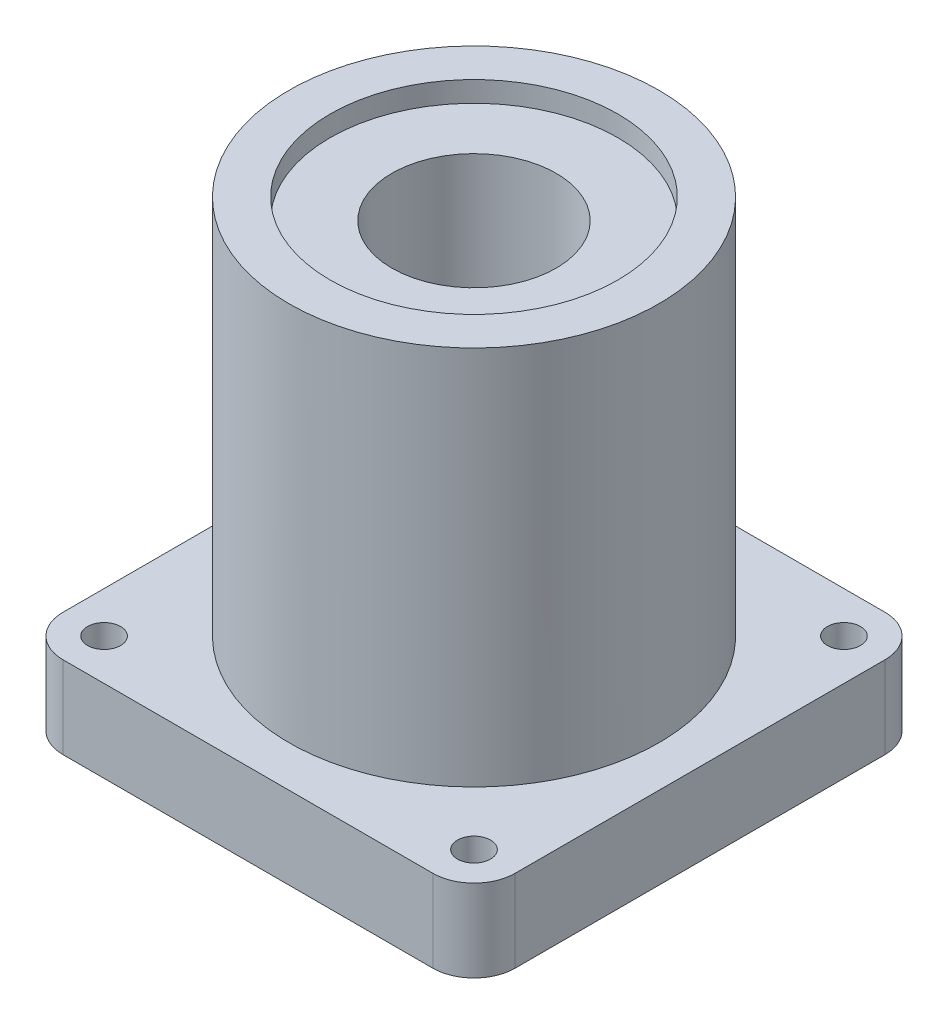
ISO-10303-21;
HEADER;
FILE_DESCRIPTION(('STEP AP214'),'2;1');
FILE_NAME('part.step','',(''),(''),'','','');
FILE_SCHEMA(('AUTOMOTIVE_DESIGN { 1 0 10303 214 1 1 1 1 }'));
ENDSEC;
DATA;
#1=APPLICATION_CONTEXT('core data for automotive mechanical design processes');
#2=APPLICATION_PROTOCOL_DEFINITION('international standard','automotive_design',2000,#1);
#3=PRODUCT_CONTEXT('',#1,'mechanical');
#4=PRODUCT('Part','Part','',(#3));
#5=PRODUCT_RELATED_PRODUCT_CATEGORY('part','',(#4));
#6=PRODUCT_DEFINITION_FORMATION('','',#4);
#7=PRODUCT_DEFINITION_CONTEXT('part definition',#1,'design');
#8=PRODUCT_DEFINITION('design','',#6,#7);
#9=PRODUCT_DEFINITION_SHAPE('','',#8);
#10=(LENGTH_UNIT() NAMED_UNIT(*) SI_UNIT(.MILLI.,.METRE.));
#11=(NAMED_UNIT(*) PLANE_ANGLE_UNIT() SI_UNIT($,.RADIAN.));
#12=(NAMED_UNIT(*) SI_UNIT($,.STERADIAN.) SOLID_ANGLE_UNIT());
#13=UNCERTAINTY_MEASURE_WITH_UNIT(LENGTH_MEASURE(1.E-05),#10,'distance_accuracy_value','');
#14=(GEOMETRIC_REPRESENTATION_CONTEXT(3) GLOBAL_UNCERTAINTY_ASSIGNED_CONTEXT((#13)) GLOBAL_UNIT_ASSIGNED_CONTEXT((#10,
#11,#12)) REPRESENTATION_CONTEXT('',''));
#15=CARTESIAN_POINT('',(0.,0.,0.));
#16=DIRECTION('',(0.,0.,1.));
#17=DIRECTION('',(1.,0.,0.));
#18=AXIS2_PLACEMENT_3D('',#15,#16,#17);
#19=CARTESIAN_POINT('',(0.,0.,0.));
#20=DIRECTION('',(0.,1.,0.));
#21=DIRECTION('',(0.,0.,1.));
#22=AXIS2_PLACEMENT_3D('',#19,#20,#21);
#23=CYLINDRICAL_SURFACE('',#22,12.7);
#24=CARTESIAN_POINT('',(0.,0.,0.));
#25=DIRECTION('',(0.,1.,0.));
#26=DIRECTION('',(0.,0.,1.));
#27=AXIS2_PLACEMENT_3D('',#24,#25,#26);
#28=CIRCLE('',#27,12.7);
#29=CARTESIAN_POINT('',(0.,0.,12.7));
#30=VERTEX_POINT('',#29);
#31=EDGE_CURVE('E181',#30,#30,#28,.T.);
#32=ORIENTED_EDGE('',*,*,#31,.F.);
#33=EDGE_LOOP('',(#32));
#34=FACE_BOUND('',#33,.T.);
#35=CARTESIAN_POINT('',(0.,68.2625,0.));
#36=DIRECTION('',(0.,1.,0.));
#37=DIRECTION('',(0.,0.,1.));
#38=AXIS2_PLACEMENT_3D('',#35,#36,#37);
#39=CIRCLE('',#38,12.7);
#40=CARTESIAN_POINT('',(0.,68.2625,12.7));
#41=VERTEX_POINT('',#40);
#42=EDGE_CURVE('E128',#41,#41,#39,.F.);
#43=ORIENTED_EDGE('',*,*,#42,.F.);
#44=EDGE_LOOP('',(#43));
#45=FACE_BOUND('',#44,.T.);
#46=ADVANCED_FACE('F30',(#34,#45),#23,.F.);
#47=CARTESIAN_POINT('',(-34.925,12.7,34.925));
#48=DIRECTION('',(0.,-1.,0.));
#49=DIRECTION('',(0.,0.,-1.));
#50=AXIS2_PLACEMENT_3D('',#47,#48,#49);
#51=PLANE('',#50);
#52=CARTESIAN_POINT('',(28.5749999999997,12.7,-28.5750000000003));
#53=DIRECTION('',(0.,1.,0.));
#54=DIRECTION('',(0.,0.,1.));
#55=AXIS2_PLACEMENT_3D('',#52,#53,#54);
#56=CIRCLE('',#55,2.55269999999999);
#57=CARTESIAN_POINT('',(28.5749999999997,12.7,-26.0223000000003));
#58=VERTEX_POINT('',#57);
#59=EDGE_CURVE('E171',#58,#58,#56,.T.);
#60=ORIENTED_EDGE('',*,*,#59,.F.);
#61=EDGE_LOOP('',(#60));
#62=FACE_BOUND('',#61,.T.);
#63=CARTESIAN_POINT('',(28.5750000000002,12.7,28.5749999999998));
#64=DIRECTION('',(0.,1.,0.));
#65=DIRECTION('',(0.,0.,1.));
#66=AXIS2_PLACEMENT_3D('',#63,#64,#65);
#67=CIRCLE('',#66,2.55269999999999);
#68=CARTESIAN_POINT('',(28.5750000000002,12.7,31.1276999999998));
#69=VERTEX_POINT('',#68);
#70=EDGE_CURVE('E161',#69,#69,#67,.T.);
#71=ORIENTED_EDGE('',*,*,#70,.F.);
#72=EDGE_LOOP('',(#71));
#73=FACE_BOUND('',#72,.T.);
#74=CARTESIAN_POINT('',(-28.5749999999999,12.7,28.5750000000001));
#75=DIRECTION('',(0.,1.,0.));
#76=DIRECTION('',(0.,0.,1.));
#77=AXIS2_PLACEMENT_3D('',#74,#75,#76);
#78=CIRCLE('',#77,2.55269999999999);
#79=CARTESIAN_POINT('',(-28.5749999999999,12.7,31.1277000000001));
#80=VERTEX_POINT('',#79);
#81=EDGE_CURVE('E158',#80,#80,#78,.T.);
#82=ORIENTED_EDGE('',*,*,#81,.F.);
#83=EDGE_LOOP('',(#82));
#84=FACE_BOUND('',#83,.T.);
#85=CARTESIAN_POINT('',(-28.575,12.7,-28.575));
#86=DIRECTION('',(0.,1.,0.));
#87=DIRECTION('',(0.,0.,1.));
#88=AXIS2_PLACEMENT_3D('',#85,#86,#87);
#89=CIRCLE('',#88,2.55269999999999);
#90=CARTESIAN_POINT('',(-28.575,12.7,-26.0223));
#91=VERTEX_POINT('',#90);
#92=EDGE_CURVE('E155',#91,#91,#89,.T.);
#93=ORIENTED_EDGE('',*,*,#92,.F.);
#94=EDGE_LOOP('',(#93));
#95=FACE_BOUND('',#94,.T.);
#96=DIRECTION('',(1.,0.,0.));
#97=VECTOR('',#96,1.);
#98=CARTESIAN_POINT('',(-34.925,12.7,34.925));
#99=LINE('',#98,#97);
#100=CARTESIAN_POINT('',(-28.575,12.7,34.925));
#101=VERTEX_POINT('',#100);
#102=CARTESIAN_POINT('',(28.575,12.7,34.925));
#103=VERTEX_POINT('',#102);
#104=EDGE_CURVE('E125',#101,#103,#99,.T.);
#105=ORIENTED_EDGE('',*,*,#104,.T.);
#106=CARTESIAN_POINT('',(28.575,12.7,28.575));
#107=DIRECTION('',(0.,-1.,0.));
#108=DIRECTION('',(0.,0.,-1.));
#109=AXIS2_PLACEMENT_3D('',#106,#107,#108);
#110=CIRCLE('',#109,6.35);
#111=CARTESIAN_POINT('',(34.925,12.7,28.575));
#112=VERTEX_POINT('',#111);
#113=EDGE_CURVE('E144',#103,#112,#110,.F.);
#114=ORIENTED_EDGE('',*,*,#113,.T.);
#115=DIRECTION('',(0.,0.,1.));
#116=VECTOR('',#115,1.);
#117=CARTESIAN_POINT('',(34.925,12.7,-34.925));
#118=LINE('',#117,#116);
#119=CARTESIAN_POINT('',(34.925,12.7,-28.575));
#120=VERTEX_POINT('',#119);
#121=EDGE_CURVE('E198',#120,#112,#118,.T.);
#122=ORIENTED_EDGE('',*,*,#121,.F.);
#123=CARTESIAN_POINT('',(28.575,12.7,-28.575));
#124=DIRECTION('',(0.,-1.,0.));
#125=DIRECTION('',(0.,0.,-1.));
#126=AXIS2_PLACEMENT_3D('',#123,#124,#125);
#127=CIRCLE('',#126,6.35);
#128=CARTESIAN_POINT('',(28.575,12.7,-34.925));
#129=VERTEX_POINT('',#128);
#130=EDGE_CURVE('E54',#120,#129,#127,.F.);
#131=ORIENTED_EDGE('',*,*,#130,.T.);
#132=DIRECTION('',(-1.,0.,0.));
#133=VECTOR('',#132,1.);
#134=CARTESIAN_POINT('',(34.925,12.7,-34.925));
#135=LINE('',#134,#133);
#136=CARTESIAN_POINT('',(-28.575,12.7,-34.925));
#137=VERTEX_POINT('',#136);
#138=EDGE_CURVE('E196',#129,#137,#135,.T.);
#139=ORIENTED_EDGE('',*,*,#138,.T.);
#140=CARTESIAN_POINT('',(-28.575,12.7,-28.575));
#141=DIRECTION('',(0.,-1.,0.));
#142=DIRECTION('',(0.,0.,-1.));
#143=AXIS2_PLACEMENT_3D('',#140,#141,#142);
#144=CIRCLE('',#143,6.35);
#145=CARTESIAN_POINT('',(-34.925,12.7,-28.575));
#146=VERTEX_POINT('',#145);
#147=EDGE_CURVE('E139',#137,#146,#144,.F.);
#148=ORIENTED_EDGE('',*,*,#147,.T.);
#149=DIRECTION('',(0.,0.,-1.));
#150=VECTOR('',#149,1.);
#151=CARTESIAN_POINT('',(-34.925,12.7,34.925));
#152=LINE('',#151,#150);
#153=CARTESIAN_POINT('',(-34.925,12.7,28.575));
#154=VERTEX_POINT('',#153);
#155=EDGE_CURVE('E193',#154,#146,#152,.T.);
#156=ORIENTED_EDGE('',*,*,#155,.F.);
#157=CARTESIAN_POINT('',(-28.575,12.7,28.575));
#158=DIRECTION('',(0.,-1.,0.));
#159=DIRECTION('',(0.,0.,-1.));
#160=AXIS2_PLACEMENT_3D('',#157,#158,#159);
#161=CIRCLE('',#160,6.35);
#162=EDGE_CURVE('E141',#154,#101,#161,.F.);
#163=ORIENTED_EDGE('',*,*,#162,.T.);
#164=EDGE_LOOP('',(#105,#114,#122,#131,#139,#148,#156,#163));
#165=FACE_BOUND('',#164,.T.);
#166=CARTESIAN_POINT('',(0.,12.7,0.));
#167=DIRECTION('',(0.,-1.,0.));
#168=DIRECTION('',(0.,0.,-1.));
#169=AXIS2_PLACEMENT_3D('',#166,#167,#168);
#170=CIRCLE('',#169,28.575);
#171=CARTESIAN_POINT('',(0.,12.7,-28.575));
#172=VERTEX_POINT('',#171);
#173=EDGE_CURVE('E120',#172,#172,#170,.F.);
#174=ORIENTED_EDGE('',*,*,#173,.F.);
#175=EDGE_LOOP('',(#174));
#176=FACE_BOUND('',#175,.T.);
#177=ADVANCED_FACE('F202',(#62,#73,#84,#95,#165,#176),#51,.F.);
#178=CARTESIAN_POINT('',(-34.925,12.7,34.925));
#179=DIRECTION('',(-1.,0.,0.));
#180=DIRECTION('',(0.,0.,1.));
#181=AXIS2_PLACEMENT_3D('',#178,#179,#180);
#182=PLANE('',#181);
#183=DIRECTION('',(0.,0.,-1.));
#184=VECTOR('',#183,1.);
#185=CARTESIAN_POINT('',(-34.925,0.,34.925));
#186=LINE('',#185,#184);
#187=CARTESIAN_POINT('',(-34.925,0.,28.575));
#188=VERTEX_POINT('',#187);
#189=CARTESIAN_POINT('',(-34.925,0.,-28.575));
#190=VERTEX_POINT('',#189);
#191=EDGE_CURVE('E186',#188,#190,#186,.T.);
#192=ORIENTED_EDGE('',*,*,#191,.F.);
#193=DIRECTION('',(0.,-1.,0.));
#194=VECTOR('',#193,1.);
#195=CARTESIAN_POINT('',(-34.925,12.7,28.575));
#196=LINE('',#195,#194);
#197=EDGE_CURVE('E11',#188,#154,#196,.F.);
#198=ORIENTED_EDGE('',*,*,#197,.T.);
#199=ORIENTED_EDGE('',*,*,#155,.T.);
#200=DIRECTION('',(0.,-1.,0.));
#201=VECTOR('',#200,1.);
#202=CARTESIAN_POINT('',(-34.925,0.,-28.575));
#203=LINE('',#202,#201);
#204=EDGE_CURVE('E39',#146,#190,#203,.T.);
#205=ORIENTED_EDGE('',*,*,#204,.T.);
#206=EDGE_LOOP('',(#192,#198,#199,#205));
#207=FACE_BOUND('',#206,.T.);
#208=ADVANCED_FACE('F32',(#207),#182,.T.);
#209=CARTESIAN_POINT('',(-34.925,12.7,34.925));
#210=DIRECTION('',(0.,0.,-1.));
#211=DIRECTION('',(-1.,0.,0.));
#212=AXIS2_PLACEMENT_3D('',#209,#210,#211);
#213=PLANE('',#212);
#214=DIRECTION('',(1.,0.,0.));
#215=VECTOR('',#214,1.);
#216=CARTESIAN_POINT('',(-34.925,0.,34.925));
#217=LINE('',#216,#215);
#218=CARTESIAN_POINT('',(-28.575,0.,34.925));
#219=VERTEX_POINT('',#218);
#220=CARTESIAN_POINT('',(28.575,0.,34.925));
#221=VERTEX_POINT('',#220);
#222=EDGE_CURVE('E117',#219,#221,#217,.T.);
#223=ORIENTED_EDGE('',*,*,#222,.T.);
#224=DIRECTION('',(0.,-1.,0.));
#225=VECTOR('',#224,1.);
#226=CARTESIAN_POINT('',(28.575,12.7,34.925));
#227=LINE('',#226,#225);
#228=EDGE_CURVE('E137',#221,#103,#227,.F.);
#229=ORIENTED_EDGE('',*,*,#228,.T.);
#230=ORIENTED_EDGE('',*,*,#104,.F.);
#231=DIRECTION('',(0.,-1.,0.));
#232=VECTOR('',#231,1.);
#233=CARTESIAN_POINT('',(-28.575,0.,34.925));
#234=LINE('',#233,#232);
#235=EDGE_CURVE('E134',#101,#219,#234,.T.);
#236=ORIENTED_EDGE('',*,*,#235,.T.);
#237=EDGE_LOOP('',(#223,#229,#230,#236));
#238=FACE_BOUND('',#237,.T.);
#239=ADVANCED_FACE('F212',(#238),#213,.F.);
#240=CARTESIAN_POINT('',(34.925,12.7,-34.925));
#241=DIRECTION('',(1.,0.,0.));
#242=DIRECTION('',(0.,0.,-1.));
#243=AXIS2_PLACEMENT_3D('',#240,#241,#242);
#244=PLANE('',#243);
#245=ORIENTED_EDGE('',*,*,#121,.T.);
#246=DIRECTION('',(0.,-1.,0.));
#247=VECTOR('',#246,1.);
#248=CARTESIAN_POINT('',(34.925,0.,28.575));
#249=LINE('',#248,#247);
#250=CARTESIAN_POINT('',(34.925,0.,28.575));
#251=VERTEX_POINT('',#250);
#252=EDGE_CURVE('E116',#112,#251,#249,.T.);
#253=ORIENTED_EDGE('',*,*,#252,.T.);
#254=DIRECTION('',(0.,0.,1.));
#255=VECTOR('',#254,1.);
#256=CARTESIAN_POINT('',(34.925,0.,-34.925));
#257=LINE('',#256,#255);
#258=CARTESIAN_POINT('',(34.925,0.,-28.575));
#259=VERTEX_POINT('',#258);
#260=EDGE_CURVE('E101',#259,#251,#257,.T.);
#261=ORIENTED_EDGE('',*,*,#260,.F.);
#262=DIRECTION('',(0.,-1.,0.));
#263=VECTOR('',#262,1.);
#264=CARTESIAN_POINT('',(34.925,12.7,-28.575));
#265=LINE('',#264,#263);
#266=EDGE_CURVE('E114',#259,#120,#265,.F.);
#267=ORIENTED_EDGE('',*,*,#266,.T.);
#268=EDGE_LOOP('',(#245,#253,#261,#267));
#269=FACE_BOUND('',#268,.T.);
#270=ADVANCED_FACE('F113',(#269),#244,.T.);
#271=CARTESIAN_POINT('',(34.925,12.7,-34.925));
#272=DIRECTION('',(0.,0.,1.));
#273=DIRECTION('',(1.,0.,0.));
#274=AXIS2_PLACEMENT_3D('',#271,#272,#273);
#275=PLANE('',#274);
#276=ORIENTED_EDGE('',*,*,#138,.F.);
#277=DIRECTION('',(0.,-1.,0.));
#278=VECTOR('',#277,1.);
#279=CARTESIAN_POINT('',(28.575,0.,-34.925));
#280=LINE('',#279,#278);
#281=CARTESIAN_POINT('',(28.575,0.,-34.925));
#282=VERTEX_POINT('',#281);
#283=EDGE_CURVE('E147',#129,#282,#280,.T.);
#284=ORIENTED_EDGE('',*,*,#283,.T.);
#285=DIRECTION('',(-1.,0.,0.));
#286=VECTOR('',#285,1.);
#287=CARTESIAN_POINT('',(34.925,0.,-34.925));
#288=LINE('',#287,#286);
#289=CARTESIAN_POINT('',(-28.575,0.,-34.925));
#290=VERTEX_POINT('',#289);
#291=EDGE_CURVE('E102',#282,#290,#288,.T.);
#292=ORIENTED_EDGE('',*,*,#291,.T.);
#293=DIRECTION('',(0.,-1.,0.));
#294=VECTOR('',#293,1.);
#295=CARTESIAN_POINT('',(-28.575,12.7,-34.925));
#296=LINE('',#295,#294);
#297=EDGE_CURVE('E47',#290,#137,#296,.F.);
#298=ORIENTED_EDGE('',*,*,#297,.T.);
#299=EDGE_LOOP('',(#276,#284,#292,#298));
#300=FACE_BOUND('',#299,.T.);
#301=ADVANCED_FACE('F222',(#300),#275,.F.);
#302=CARTESIAN_POINT('',(-34.925,0.,34.925));
#303=DIRECTION('',(0.,-1.,0.));
#304=DIRECTION('',(0.,0.,-1.));
#305=AXIS2_PLACEMENT_3D('',#302,#303,#304);
#306=PLANE('',#305);
#307=CARTESIAN_POINT('',(28.5749999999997,0.,-28.5750000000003));
#308=DIRECTION('',(0.,-1.,0.));
#309=DIRECTION('',(0.,0.,-1.));
#310=AXIS2_PLACEMENT_3D('',#307,#308,#309);
#311=CIRCLE('',#310,2.55269999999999);
#312=CARTESIAN_POINT('',(28.5749999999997,0.,-31.1277000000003));
#313=VERTEX_POINT('',#312);
#314=EDGE_CURVE('E34',#313,#313,#311,.T.);
#315=ORIENTED_EDGE('',*,*,#314,.F.);
#316=EDGE_LOOP('',(#315));
#317=FACE_BOUND('',#316,.T.);
#318=CARTESIAN_POINT('',(28.5750000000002,0.,28.5749999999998));
#319=DIRECTION('',(0.,-1.,0.));
#320=DIRECTION('',(0.,0.,-1.));
#321=AXIS2_PLACEMENT_3D('',#318,#319,#320);
#322=CIRCLE('',#321,2.55269999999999);
#323=CARTESIAN_POINT('',(28.5750000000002,0.,26.0222999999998));
#324=VERTEX_POINT('',#323);
#325=EDGE_CURVE('E159',#324,#324,#322,.T.);
#326=ORIENTED_EDGE('',*,*,#325,.F.);
#327=EDGE_LOOP('',(#326));
#328=FACE_BOUND('',#327,.T.);
#329=CARTESIAN_POINT('',(-28.5749999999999,0.,28.5750000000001));
#330=DIRECTION('',(0.,-1.,0.));
#331=DIRECTION('',(0.,0.,-1.));
#332=AXIS2_PLACEMENT_3D('',#329,#330,#331);
#333=CIRCLE('',#332,2.55269999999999);
#334=CARTESIAN_POINT('',(-28.5749999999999,0.,26.0223000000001));
#335=VERTEX_POINT('',#334);
#336=EDGE_CURVE('E156',#335,#335,#333,.T.);
#337=ORIENTED_EDGE('',*,*,#336,.F.);
#338=EDGE_LOOP('',(#337));
#339=FACE_BOUND('',#338,.T.);
#340=CARTESIAN_POINT('',(-28.575,0.,-28.575));
#341=DIRECTION('',(0.,-1.,0.));
#342=DIRECTION('',(0.,0.,-1.));
#343=AXIS2_PLACEMENT_3D('',#340,#341,#342);
#344=CIRCLE('',#343,2.55269999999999);
#345=CARTESIAN_POINT('',(-28.575,0.,-31.1277));
#346=VERTEX_POINT('',#345);
#347=EDGE_CURVE('E151',#346,#346,#344,.T.);
#348=ORIENTED_EDGE('',*,*,#347,.F.);
#349=EDGE_LOOP('',(#348));
#350=FACE_BOUND('',#349,.T.);
#351=ORIENTED_EDGE('',*,*,#31,.T.);
#352=EDGE_LOOP('',(#351));
#353=FACE_BOUND('',#352,.T.);
#354=ORIENTED_EDGE('',*,*,#260,.T.);
#355=CARTESIAN_POINT('',(28.575,0.,28.575));
#356=DIRECTION('',(0.,-1.,0.));
#357=DIRECTION('',(0.,0.,-1.));
#358=AXIS2_PLACEMENT_3D('',#355,#356,#357);
#359=CIRCLE('',#358,6.35);
#360=EDGE_CURVE('E107',#251,#221,#359,.T.);
#361=ORIENTED_EDGE('',*,*,#360,.T.);
#362=ORIENTED_EDGE('',*,*,#222,.F.);
#363=CARTESIAN_POINT('',(-28.575,0.,28.575));
#364=DIRECTION('',(0.,-1.,0.));
#365=DIRECTION('',(0.,0.,-1.));
#366=AXIS2_PLACEMENT_3D('',#363,#364,#365);
#367=CIRCLE('',#366,6.35);
#368=EDGE_CURVE('E108',#219,#188,#367,.T.);
#369=ORIENTED_EDGE('',*,*,#368,.T.);
#370=ORIENTED_EDGE('',*,*,#191,.T.);
#371=CARTESIAN_POINT('',(-28.575,0.,-28.575));
#372=DIRECTION('',(0.,-1.,0.));
#373=DIRECTION('',(0.,0.,-1.));
#374=AXIS2_PLACEMENT_3D('',#371,#372,#373);
#375=CIRCLE('',#374,6.35);
#376=EDGE_CURVE('E122',#190,#290,#375,.T.);
#377=ORIENTED_EDGE('',*,*,#376,.T.);
#378=ORIENTED_EDGE('',*,*,#291,.F.);
#379=CARTESIAN_POINT('',(28.575,0.,-28.575));
#380=DIRECTION('',(0.,-1.,0.));
#381=DIRECTION('',(0.,0.,-1.));
#382=AXIS2_PLACEMENT_3D('',#379,#380,#381);
#383=CIRCLE('',#382,6.35);
#384=EDGE_CURVE('E98',#282,#259,#383,.T.);
#385=ORIENTED_EDGE('',*,*,#384,.T.);
#386=EDGE_LOOP('',(#354,#361,#362,#369,#370,#377,#378,#385));
#387=FACE_BOUND('',#386,.T.);
#388=ADVANCED_FACE('F100',(#317,#328,#339,#350,#353,#387),#306,.T.);
#389=CARTESIAN_POINT('',(0.,71.4375,0.));
#390=DIRECTION('',(0.,-1.,0.));
#391=DIRECTION('',(0.,0.,-1.));
#392=AXIS2_PLACEMENT_3D('',#389,#390,#391);
#393=CYLINDRICAL_SURFACE('',#392,28.575);
#394=CARTESIAN_POINT('',(0.,71.4375,0.));
#395=DIRECTION('',(0.,1.,0.));
#396=DIRECTION('',(0.,0.,1.));
#397=AXIS2_PLACEMENT_3D('',#394,#395,#396);
#398=CIRCLE('',#397,28.575);
#399=CARTESIAN_POINT('',(0.,71.4375,28.575));
#400=VERTEX_POINT('',#399);
#401=EDGE_CURVE('E184',#400,#400,#398,.T.);
#402=ORIENTED_EDGE('',*,*,#401,.F.);
#403=EDGE_LOOP('',(#402));
#404=FACE_BOUND('',#403,.T.);
#405=ORIENTED_EDGE('',*,*,#173,.T.);
#406=EDGE_LOOP('',(#405));
#407=FACE_BOUND('',#406,.T.);
#408=ADVANCED_FACE('F229',(#404,#407),#393,.T.);
#409=CARTESIAN_POINT('',(0.,71.4375,0.));
#410=DIRECTION('',(0.,1.,0.));
#411=DIRECTION('',(0.,0.,1.));
#412=AXIS2_PLACEMENT_3D('',#409,#410,#411);
#413=PLANE('',#412);
#414=CARTESIAN_POINT('',(0.,71.4375,0.));
#415=DIRECTION('',(0.,1.,0.));
#416=DIRECTION('',(0.,0.,1.));
#417=AXIS2_PLACEMENT_3D('',#414,#415,#416);
#418=CIRCLE('',#417,22.225);
#419=CARTESIAN_POINT('',(0.,71.4375,22.225));
#420=VERTEX_POINT('',#419);
#421=EDGE_CURVE('E154',#420,#420,#418,.T.);
#422=ORIENTED_EDGE('',*,*,#421,.F.);
#423=EDGE_LOOP('',(#422));
#424=FACE_BOUND('',#423,.T.);
#425=ORIENTED_EDGE('',*,*,#401,.T.);
#426=EDGE_LOOP('',(#425));
#427=FACE_BOUND('',#426,.T.);
#428=ADVANCED_FACE('F249',(#424,#427),#413,.T.);
#429=CARTESIAN_POINT('',(0.,68.2625,0.));
#430=DIRECTION('',(0.,1.,0.));
#431=DIRECTION('',(0.,0.,1.));
#432=AXIS2_PLACEMENT_3D('',#429,#430,#431);
#433=PLANE('',#432);
#434=CARTESIAN_POINT('',(0.,68.2625,0.));
#435=DIRECTION('',(0.,1.,0.));
#436=DIRECTION('',(0.,0.,1.));
#437=AXIS2_PLACEMENT_3D('',#434,#435,#436);
#438=CIRCLE('',#437,22.225);
#439=CARTESIAN_POINT('',(0.,68.2625,22.225));
#440=VERTEX_POINT('',#439);
#441=EDGE_CURVE('E178',#440,#440,#438,.T.);
#442=ORIENTED_EDGE('',*,*,#441,.T.);
#443=EDGE_LOOP('',(#442));
#444=FACE_BOUND('',#443,.T.);
#445=ORIENTED_EDGE('',*,*,#42,.T.);
#446=EDGE_LOOP('',(#445));
#447=FACE_BOUND('',#446,.T.);
#448=ADVANCED_FACE('F251',(#444,#447),#433,.T.);
#449=CARTESIAN_POINT('',(0.,68.2625,0.));
#450=DIRECTION('',(0.,1.,0.));
#451=DIRECTION('',(0.,0.,1.));
#452=AXIS2_PLACEMENT_3D('',#449,#450,#451);
#453=CYLINDRICAL_SURFACE('',#452,22.225);
#454=ORIENTED_EDGE('',*,*,#441,.F.);
#455=EDGE_LOOP('',(#454));
#456=FACE_BOUND('',#455,.T.);
#457=ORIENTED_EDGE('',*,*,#421,.T.);
#458=EDGE_LOOP('',(#457));
#459=FACE_BOUND('',#458,.T.);
#460=ADVANCED_FACE('F247',(#456,#459),#453,.F.);
#461=CARTESIAN_POINT('',(28.575,12.7,28.575));
#462=DIRECTION('',(0.,1.,0.));
#463=DIRECTION('',(0.,0.,1.));
#464=AXIS2_PLACEMENT_3D('',#461,#462,#463);
#465=CYLINDRICAL_SURFACE('',#464,6.35);
#466=ORIENTED_EDGE('',*,*,#113,.F.);
#467=ORIENTED_EDGE('',*,*,#228,.F.);
#468=ORIENTED_EDGE('',*,*,#360,.F.);
#469=ORIENTED_EDGE('',*,*,#252,.F.);
#470=EDGE_LOOP('',(#466,#467,#468,#469));
#471=FACE_BOUND('',#470,.T.);
#472=ADVANCED_FACE('F210',(#471),#465,.T.);
#473=CARTESIAN_POINT('',(28.575,12.7,-28.575));
#474=DIRECTION('',(0.,1.,0.));
#475=DIRECTION('',(0.,0.,1.));
#476=AXIS2_PLACEMENT_3D('',#473,#474,#475);
#477=CYLINDRICAL_SURFACE('',#476,6.35);
#478=ORIENTED_EDGE('',*,*,#130,.F.);
#479=ORIENTED_EDGE('',*,*,#266,.F.);
#480=ORIENTED_EDGE('',*,*,#384,.F.);
#481=ORIENTED_EDGE('',*,*,#283,.F.);
#482=EDGE_LOOP('',(#478,#479,#480,#481));
#483=FACE_BOUND('',#482,.T.);
#484=ADVANCED_FACE('F119',(#483),#477,.T.);
#485=CARTESIAN_POINT('',(-28.575,12.7,28.575));
#486=DIRECTION('',(0.,1.,0.));
#487=DIRECTION('',(0.,0.,1.));
#488=AXIS2_PLACEMENT_3D('',#485,#486,#487);
#489=CYLINDRICAL_SURFACE('',#488,6.35);
#490=ORIENTED_EDGE('',*,*,#162,.F.);
#491=ORIENTED_EDGE('',*,*,#197,.F.);
#492=ORIENTED_EDGE('',*,*,#368,.F.);
#493=ORIENTED_EDGE('',*,*,#235,.F.);
#494=EDGE_LOOP('',(#490,#491,#492,#493));
#495=FACE_BOUND('',#494,.T.);
#496=ADVANCED_FACE('F214',(#495),#489,.T.);
#497=CARTESIAN_POINT('',(-28.575,12.7,-28.575));
#498=DIRECTION('',(0.,1.,0.));
#499=DIRECTION('',(0.,0.,1.));
#500=AXIS2_PLACEMENT_3D('',#497,#498,#499);
#501=CYLINDRICAL_SURFACE('',#500,6.35);
#502=ORIENTED_EDGE('',*,*,#147,.F.);
#503=ORIENTED_EDGE('',*,*,#297,.F.);
#504=ORIENTED_EDGE('',*,*,#376,.F.);
#505=ORIENTED_EDGE('',*,*,#204,.F.);
#506=EDGE_LOOP('',(#502,#503,#504,#505));
#507=FACE_BOUND('',#506,.T.);
#508=ADVANCED_FACE('F221',(#507),#501,.T.);
#509=CARTESIAN_POINT('',(-28.575,12.7,-28.575));
#510=DIRECTION('',(0.,1.,0.));
#511=DIRECTION('',(0.,0.,1.));
#512=AXIS2_PLACEMENT_3D('',#509,#510,#511);
#513=CYLINDRICAL_SURFACE('',#512,2.55269999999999);
#514=ORIENTED_EDGE('',*,*,#347,.T.);
#515=EDGE_LOOP('',(#514));
#516=FACE_BOUND('',#515,.T.);
#517=ORIENTED_EDGE('',*,*,#92,.T.);
#518=EDGE_LOOP('',(#517));
#519=FACE_BOUND('',#518,.T.);
#520=ADVANCED_FACE('F309',(#516,#519),#513,.F.);
#521=CARTESIAN_POINT('',(-28.5749999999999,12.7,28.5750000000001));
#522=DIRECTION('',(0.,1.,0.));
#523=DIRECTION('',(0.,0.,1.));
#524=AXIS2_PLACEMENT_3D('',#521,#522,#523);
#525=CYLINDRICAL_SURFACE('',#524,2.55269999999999);
#526=ORIENTED_EDGE('',*,*,#336,.T.);
#527=EDGE_LOOP('',(#526));
#528=FACE_BOUND('',#527,.T.);
#529=ORIENTED_EDGE('',*,*,#81,.T.);
#530=EDGE_LOOP('',(#529));
#531=FACE_BOUND('',#530,.T.);
#532=ADVANCED_FACE('F304',(#528,#531),#525,.F.);
#533=CARTESIAN_POINT('',(28.5750000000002,12.7,28.5749999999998));
#534=DIRECTION('',(0.,1.,0.));
#535=DIRECTION('',(0.,0.,1.));
#536=AXIS2_PLACEMENT_3D('',#533,#534,#535);
#537=CYLINDRICAL_SURFACE('',#536,2.55269999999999);
#538=ORIENTED_EDGE('',*,*,#325,.T.);
#539=EDGE_LOOP('',(#538));
#540=FACE_BOUND('',#539,.T.);
#541=ORIENTED_EDGE('',*,*,#70,.T.);
#542=EDGE_LOOP('',(#541));
#543=FACE_BOUND('',#542,.T.);
#544=ADVANCED_FACE('F308',(#540,#543),#537,.F.);
#545=CARTESIAN_POINT('',(28.5749999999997,12.7,-28.5750000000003));
#546=DIRECTION('',(0.,1.,0.));
#547=DIRECTION('',(0.,0.,1.));
#548=AXIS2_PLACEMENT_3D('',#545,#546,#547);
#549=CYLINDRICAL_SURFACE('',#548,2.55269999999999);
#550=ORIENTED_EDGE('',*,*,#314,.T.);
#551=EDGE_LOOP('',(#550));
#552=FACE_BOUND('',#551,.T.);
#553=ORIENTED_EDGE('',*,*,#59,.T.);
#554=EDGE_LOOP('',(#553));
#555=FACE_BOUND('',#554,.T.);
#556=ADVANCED_FACE('F318',(#552,#555),#549,.F.);
#557=CLOSED_SHELL('',(#46,#177,#208,#239,#270,#301,#388,#408,#428,#448,#460,#472,#484,#496,#508,
#520,#532,#544,#556));
#558=MANIFOLD_SOLID_BREP('B2',#557);
#559=ADVANCED_BREP_SHAPE_REPRESENTATION('',(#18,#558),#14);
#560=SHAPE_DEFINITION_REPRESENTATION(#9,#559);
ENDSEC;
END-ISO-10303-21;
